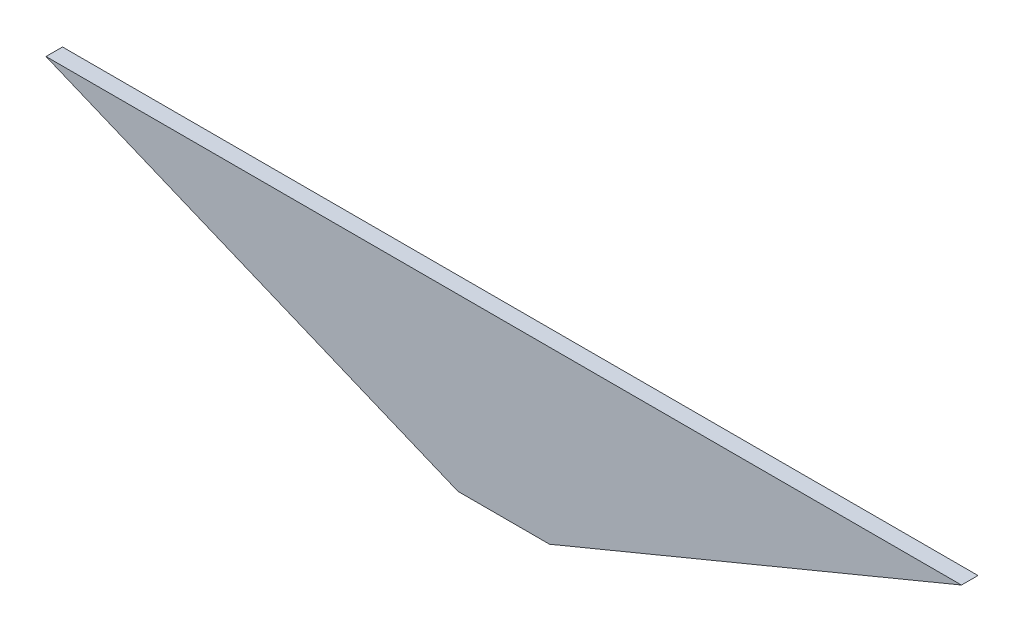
from build123d import *

# Parameters (mm, degrees)
BOSS_EXTRU_1_DEPTH = 2.5


with BuildPart() as part:
    # Esquisse1 → Boss.-Extru.1 (new, symmetric)
    with BuildSketch(Plane.XY):
        Polygon((-138.582, 51.662), (138.582, 51.662), (13.858, 0), (-13.858, 0), align=None)
    extrude(amount=BOSS_EXTRU_1_DEPTH, both=True)


solid = part.part
